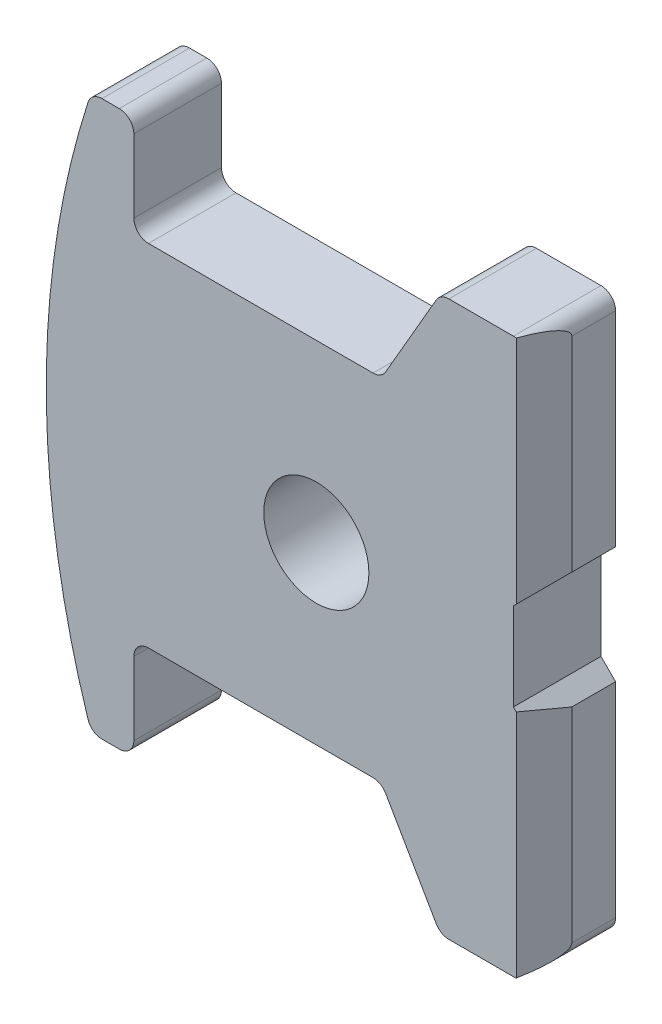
ISO-10303-21;
HEADER;
FILE_DESCRIPTION(('STEP AP214'),'2;1');
FILE_NAME('part.step','',(''),(''),'','','');
FILE_SCHEMA(('AUTOMOTIVE_DESIGN { 1 0 10303 214 1 1 1 1 }'));
ENDSEC;
DATA;
#1=APPLICATION_CONTEXT('core data for automotive mechanical design processes');
#2=APPLICATION_PROTOCOL_DEFINITION('international standard','automotive_design',2000,#1);
#3=PRODUCT_CONTEXT('',#1,'mechanical');
#4=PRODUCT('Part','Part','',(#3));
#5=PRODUCT_RELATED_PRODUCT_CATEGORY('part','',(#4));
#6=PRODUCT_DEFINITION_FORMATION('','',#4);
#7=PRODUCT_DEFINITION_CONTEXT('part definition',#1,'design');
#8=PRODUCT_DEFINITION('design','',#6,#7);
#9=PRODUCT_DEFINITION_SHAPE('','',#8);
#10=(LENGTH_UNIT() NAMED_UNIT(*) SI_UNIT(.MILLI.,.METRE.));
#11=(NAMED_UNIT(*) PLANE_ANGLE_UNIT() SI_UNIT($,.RADIAN.));
#12=(NAMED_UNIT(*) SI_UNIT($,.STERADIAN.) SOLID_ANGLE_UNIT());
#13=UNCERTAINTY_MEASURE_WITH_UNIT(LENGTH_MEASURE(1.E-05),#10,'distance_accuracy_value','');
#14=(GEOMETRIC_REPRESENTATION_CONTEXT(3) GLOBAL_UNCERTAINTY_ASSIGNED_CONTEXT((#13)) GLOBAL_UNIT_ASSIGNED_CONTEXT((#10,
#11,#12)) REPRESENTATION_CONTEXT('',''));
#15=CARTESIAN_POINT('',(0.,0.,0.));
#16=DIRECTION('',(0.,0.,1.));
#17=DIRECTION('',(1.,0.,0.));
#18=AXIS2_PLACEMENT_3D('',#15,#16,#17);
#19=CARTESIAN_POINT('',(-28.,19.,6.));
#20=DIRECTION('',(0.,-1.,0.));
#21=DIRECTION('',(1.,0.,0.));
#22=AXIS2_PLACEMENT_3D('',#19,#20,#21);
#23=PLANE('',#22);
#24=DIRECTION('',(-1.,0.,0.));
#25=VECTOR('',#24,1.);
#26=CARTESIAN_POINT('',(-28.,19.,0.));
#27=LINE('',#26,#25);
#28=CARTESIAN_POINT('',(-28.,19.,0.));
#29=VERTEX_POINT('',#28);
#30=CARTESIAN_POINT('',(-29.1871871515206,19.,0.));
#31=VERTEX_POINT('',#30);
#32=EDGE_CURVE('E353',#29,#31,#27,.T.);
#33=ORIENTED_EDGE('',*,*,#32,.T.);
#34=DIRECTION('',(0.,0.,1.));
#35=VECTOR('',#34,1.);
#36=CARTESIAN_POINT('',(-29.1871871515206,19.,6.));
#37=LINE('',#36,#35);
#38=CARTESIAN_POINT('',(-29.1871871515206,19.,6.));
#39=VERTEX_POINT('',#38);
#40=EDGE_CURVE('E37',#31,#39,#37,.T.);
#41=ORIENTED_EDGE('',*,*,#40,.T.);
#42=DIRECTION('',(1.,0.,0.));
#43=VECTOR('',#42,1.);
#44=CARTESIAN_POINT('',(-28.,19.,6.));
#45=LINE('',#44,#43);
#46=CARTESIAN_POINT('',(-28.,19.,6.));
#47=VERTEX_POINT('',#46);
#48=EDGE_CURVE('E210',#39,#47,#45,.T.);
#49=ORIENTED_EDGE('',*,*,#48,.T.);
#50=DIRECTION('',(0.,0.,-1.));
#51=VECTOR('',#50,1.);
#52=CARTESIAN_POINT('',(-28.,19.,6.));
#53=LINE('',#52,#51);
#54=EDGE_CURVE('E213',#47,#29,#53,.T.);
#55=ORIENTED_EDGE('',*,*,#54,.T.);
#56=EDGE_LOOP('',(#33,#41,#49,#55));
#57=FACE_BOUND('',#56,.T.);
#58=ADVANCED_FACE('F14',(#57),#23,.F.);
#59=CARTESIAN_POINT('',(-28.,-19.,6.));
#60=DIRECTION('',(0.,1.,0.));
#61=DIRECTION('',(-1.,0.,0.));
#62=AXIS2_PLACEMENT_3D('',#59,#60,#61);
#63=PLANE('',#62);
#64=DIRECTION('',(-1.,0.,0.));
#65=VECTOR('',#64,1.);
#66=CARTESIAN_POINT('',(-30.5,-19.,6.));
#67=LINE('',#66,#65);
#68=CARTESIAN_POINT('',(-28.,-19.,6.));
#69=VERTEX_POINT('',#68);
#70=CARTESIAN_POINT('',(-29.1871871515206,-19.,6.));
#71=VERTEX_POINT('',#70);
#72=EDGE_CURVE('E515',#69,#71,#67,.T.);
#73=ORIENTED_EDGE('',*,*,#72,.T.);
#74=DIRECTION('',(0.,0.,1.));
#75=VECTOR('',#74,1.);
#76=CARTESIAN_POINT('',(-29.1871871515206,-19.,0.));
#77=LINE('',#76,#75);
#78=CARTESIAN_POINT('',(-29.1871871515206,-19.,0.));
#79=VERTEX_POINT('',#78);
#80=EDGE_CURVE('E9',#71,#79,#77,.F.);
#81=ORIENTED_EDGE('',*,*,#80,.T.);
#82=DIRECTION('',(1.,0.,0.));
#83=VECTOR('',#82,1.);
#84=CARTESIAN_POINT('',(-28.,-19.,0.));
#85=LINE('',#84,#83);
#86=CARTESIAN_POINT('',(-28.,-19.,0.));
#87=VERTEX_POINT('',#86);
#88=EDGE_CURVE('E354',#79,#87,#85,.T.);
#89=ORIENTED_EDGE('',*,*,#88,.T.);
#90=DIRECTION('',(0.,0.,-1.));
#91=VECTOR('',#90,1.);
#92=CARTESIAN_POINT('',(-28.,-19.,6.));
#93=LINE('',#92,#91);
#94=EDGE_CURVE('E231',#69,#87,#93,.T.);
#95=ORIENTED_EDGE('',*,*,#94,.F.);
#96=EDGE_LOOP('',(#73,#81,#89,#95));
#97=FACE_BOUND('',#96,.T.);
#98=ADVANCED_FACE('F535',(#97),#63,.F.);
#99=CARTESIAN_POINT('',(-26.,-13.,6.));
#100=DIRECTION('',(0.,0.,1.));
#101=DIRECTION('',(0.,1.,0.));
#102=AXIS2_PLACEMENT_3D('',#99,#100,#101);
#103=PLANE('',#102);
#104=CARTESIAN_POINT('',(-14.5,0.,6.));
#105=DIRECTION('',(0.,0.,1.));
#106=DIRECTION('',(0.,1.,0.));
#107=AXIS2_PLACEMENT_3D('',#104,#105,#106);
#108=CIRCLE('',#107,3.6);
#109=CARTESIAN_POINT('',(-14.5,3.60000000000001,6.));
#110=VERTEX_POINT('',#109);
#111=EDGE_CURVE('E517',#110,#110,#108,.T.);
#112=ORIENTED_EDGE('',*,*,#111,.F.);
#113=EDGE_LOOP('',(#112));
#114=FACE_BOUND('',#113,.T.);
#115=ORIENTED_EDGE('',*,*,#48,.F.);
#116=CARTESIAN_POINT('',(-29.1871871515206,18.,6.));
#117=DIRECTION('',(0.,0.,1.));
#118=DIRECTION('',(0.,1.,0.));
#119=AXIS2_PLACEMENT_3D('',#116,#117,#118);
#120=CIRCLE('',#119,1.);
#121=CARTESIAN_POINT('',(-30.1395123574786,18.3050847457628,6.));
#122=VERTEX_POINT('',#121);
#123=EDGE_CURVE('E22',#39,#122,#120,.T.);
#124=ORIENTED_EDGE('',*,*,#123,.T.);
#125=CARTESIAN_POINT('',(27.,0.,6.));
#126=DIRECTION('',(0.,0.,1.));
#127=DIRECTION('',(0.,1.,0.));
#128=AXIS2_PLACEMENT_3D('',#125,#126,#127);
#129=CIRCLE('',#128,60.);
#130=CARTESIAN_POINT('',(-30.1395123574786,-18.3050847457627,6.));
#131=VERTEX_POINT('',#130);
#132=EDGE_CURVE('E339',#122,#131,#129,.T.);
#133=ORIENTED_EDGE('',*,*,#132,.T.);
#134=CARTESIAN_POINT('',(-29.1871871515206,-18.,6.));
#135=DIRECTION('',(0.,0.,1.));
#136=DIRECTION('',(0.,1.,0.));
#137=AXIS2_PLACEMENT_3D('',#134,#135,#136);
#138=CIRCLE('',#137,1.);
#139=EDGE_CURVE('E29',#131,#71,#138,.T.);
#140=ORIENTED_EDGE('',*,*,#139,.T.);
#141=ORIENTED_EDGE('',*,*,#72,.F.);
#142=CARTESIAN_POINT('',(-28.,-18.,6.));
#143=DIRECTION('',(0.,0.,1.));
#144=DIRECTION('',(0.,1.,0.));
#145=AXIS2_PLACEMENT_3D('',#142,#143,#144);
#146=CIRCLE('',#145,1.);
#147=CARTESIAN_POINT('',(-27.,-18.,6.));
#148=VERTEX_POINT('',#147);
#149=EDGE_CURVE('E510',#148,#69,#146,.F.);
#150=ORIENTED_EDGE('',*,*,#149,.F.);
#151=DIRECTION('',(0.,-1.,0.));
#152=VECTOR('',#151,1.);
#153=CARTESIAN_POINT('',(-27.,-18.,6.));
#154=LINE('',#153,#152);
#155=CARTESIAN_POINT('',(-27.,-13.,6.));
#156=VERTEX_POINT('',#155);
#157=EDGE_CURVE('E370',#156,#148,#154,.T.);
#158=ORIENTED_EDGE('',*,*,#157,.F.);
#159=CARTESIAN_POINT('',(-26.,-13.,6.));
#160=DIRECTION('',(0.,0.,-1.));
#161=DIRECTION('',(0.,1.,0.));
#162=AXIS2_PLACEMENT_3D('',#159,#160,#161);
#163=CIRCLE('',#162,1.);
#164=CARTESIAN_POINT('',(-26.,-12.,6.));
#165=VERTEX_POINT('',#164);
#166=EDGE_CURVE('E296',#156,#165,#163,.T.);
#167=ORIENTED_EDGE('',*,*,#166,.T.);
#168=DIRECTION('',(1.,0.,0.));
#169=VECTOR('',#168,1.);
#170=CARTESIAN_POINT('',(-10.618802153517,-12.,6.));
#171=LINE('',#170,#169);
#172=CARTESIAN_POINT('',(-10.618802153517,-12.,6.));
#173=VERTEX_POINT('',#172);
#174=EDGE_CURVE('E299',#165,#173,#171,.T.);
#175=ORIENTED_EDGE('',*,*,#174,.T.);
#176=CARTESIAN_POINT('',(-10.618802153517,-13.,6.));
#177=DIRECTION('',(0.,0.,-1.));
#178=DIRECTION('',(0.,1.,0.));
#179=AXIS2_PLACEMENT_3D('',#176,#177,#178);
#180=CIRCLE('',#179,1.);
#181=CARTESIAN_POINT('',(-9.75277674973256,-12.5,6.));
#182=VERTEX_POINT('',#181);
#183=EDGE_CURVE('E502',#173,#182,#180,.T.);
#184=ORIENTED_EDGE('',*,*,#183,.T.);
#185=DIRECTION('',(0.5,-0.86602540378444,0.));
#186=VECTOR('',#185,1.);
#187=CARTESIAN_POINT('',(-6.28867513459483,-18.5,6.));
#188=LINE('',#187,#186);
#189=CARTESIAN_POINT('',(-6.28867513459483,-18.5,6.));
#190=VERTEX_POINT('',#189);
#191=EDGE_CURVE('E500',#182,#190,#188,.T.);
#192=ORIENTED_EDGE('',*,*,#191,.T.);
#193=CARTESIAN_POINT('',(-5.42264973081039,-18.,6.));
#194=DIRECTION('',(0.,0.,1.));
#195=DIRECTION('',(0.,-1.,0.));
#196=AXIS2_PLACEMENT_3D('',#193,#194,#195);
#197=CIRCLE('',#196,1.);
#198=CARTESIAN_POINT('',(-5.42264973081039,-19.,6.));
#199=VERTEX_POINT('',#198);
#200=EDGE_CURVE('E498',#190,#199,#197,.T.);
#201=ORIENTED_EDGE('',*,*,#200,.T.);
#202=DIRECTION('',(1.,0.,0.));
#203=VECTOR('',#202,1.);
#204=CARTESIAN_POINT('',(0.,-19.,6.));
#205=LINE('',#204,#203);
#206=CARTESIAN_POINT('',(-1.00000000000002,-19.,6.));
#207=VERTEX_POINT('',#206);
#208=EDGE_CURVE('E495',#199,#207,#205,.T.);
#209=ORIENTED_EDGE('',*,*,#208,.T.);
#210=CARTESIAN_POINT('',(-1.00000000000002,-18.,6.));
#211=DIRECTION('',(0.,0.,1.));
#212=DIRECTION('',(0.,1.,0.));
#213=AXIS2_PLACEMENT_3D('',#210,#211,#212);
#214=CIRCLE('',#213,1.);
#215=CARTESIAN_POINT('',(-0.803847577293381,-18.980573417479,6.));
#216=VERTEX_POINT('',#215);
#217=EDGE_CURVE('E317',#207,#216,#214,.T.);
#218=ORIENTED_EDGE('',*,*,#217,.T.);
#219=DIRECTION('',(0.,-1.,0.));
#220=VECTOR('',#219,1.);
#221=CARTESIAN_POINT('',(-0.803847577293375,-13.,6.));
#222=LINE('',#221,#220);
#223=CARTESIAN_POINT('',(-0.803847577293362,-3.19615242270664,6.));
#224=VERTEX_POINT('',#223);
#225=EDGE_CURVE('E281',#224,#216,#222,.T.);
#226=ORIENTED_EDGE('',*,*,#225,.F.);
#227=DIRECTION('',(-0.707106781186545,0.70710678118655,0.));
#228=VECTOR('',#227,1.);
#229=CARTESIAN_POINT('',(0.,-4.,6.));
#230=LINE('',#229,#228);
#231=CARTESIAN_POINT('',(-1.,-3.,6.));
#232=VERTEX_POINT('',#231);
#233=EDGE_CURVE('E489',#224,#232,#230,.T.);
#234=ORIENTED_EDGE('',*,*,#233,.T.);
#235=DIRECTION('',(0.,1.,0.));
#236=VECTOR('',#235,1.);
#237=CARTESIAN_POINT('',(-1.,-3.,6.));
#238=LINE('',#237,#236);
#239=CARTESIAN_POINT('',(-1.,3.,6.));
#240=VERTEX_POINT('',#239);
#241=EDGE_CURVE('E484',#232,#240,#238,.T.);
#242=ORIENTED_EDGE('',*,*,#241,.T.);
#243=DIRECTION('',(0.707106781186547,0.707106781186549,0.));
#244=VECTOR('',#243,1.);
#245=CARTESIAN_POINT('',(0.,4.,6.));
#246=LINE('',#245,#244);
#247=CARTESIAN_POINT('',(-0.803847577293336,3.19615242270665,6.));
#248=VERTEX_POINT('',#247);
#249=EDGE_CURVE('E482',#240,#248,#246,.T.);
#250=ORIENTED_EDGE('',*,*,#249,.T.);
#251=CARTESIAN_POINT('',(-0.803847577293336,18.980573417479,6.));
#252=VERTEX_POINT('',#251);
#253=EDGE_CURVE('E305',#252,#248,#222,.T.);
#254=ORIENTED_EDGE('',*,*,#253,.F.);
#255=CARTESIAN_POINT('',(-0.999999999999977,18.,6.));
#256=DIRECTION('',(0.,0.,1.));
#257=DIRECTION('',(0.,1.,0.));
#258=AXIS2_PLACEMENT_3D('',#255,#256,#257);
#259=CIRCLE('',#258,1.);
#260=CARTESIAN_POINT('',(-0.999999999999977,19.,6.));
#261=VERTEX_POINT('',#260);
#262=EDGE_CURVE('E315',#252,#261,#259,.T.);
#263=ORIENTED_EDGE('',*,*,#262,.T.);
#264=DIRECTION('',(-1.,0.,0.));
#265=VECTOR('',#264,1.);
#266=CARTESIAN_POINT('',(-5.42264973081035,19.,6.));
#267=LINE('',#266,#265);
#268=CARTESIAN_POINT('',(-5.42264973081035,19.,6.));
#269=VERTEX_POINT('',#268);
#270=EDGE_CURVE('E462',#261,#269,#267,.T.);
#271=ORIENTED_EDGE('',*,*,#270,.T.);
#272=CARTESIAN_POINT('',(-5.42264973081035,18.,6.));
#273=DIRECTION('',(0.,0.,1.));
#274=DIRECTION('',(0.,1.,0.));
#275=AXIS2_PLACEMENT_3D('',#272,#273,#274);
#276=CIRCLE('',#275,1.);
#277=CARTESIAN_POINT('',(-6.28867513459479,18.5,6.));
#278=VERTEX_POINT('',#277);
#279=EDGE_CURVE('E457',#269,#278,#276,.T.);
#280=ORIENTED_EDGE('',*,*,#279,.T.);
#281=DIRECTION('',(-0.5,-0.866025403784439,0.));
#282=VECTOR('',#281,1.);
#283=CARTESIAN_POINT('',(-9.75277674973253,12.5,6.));
#284=LINE('',#283,#282);
#285=CARTESIAN_POINT('',(-9.75277674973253,12.5,6.));
#286=VERTEX_POINT('',#285);
#287=EDGE_CURVE('E453',#278,#286,#284,.T.);
#288=ORIENTED_EDGE('',*,*,#287,.T.);
#289=CARTESIAN_POINT('',(-10.618802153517,13.,6.));
#290=DIRECTION('',(0.,0.,-1.));
#291=DIRECTION('',(0.,-1.,0.));
#292=AXIS2_PLACEMENT_3D('',#289,#290,#291);
#293=CIRCLE('',#292,1.);
#294=CARTESIAN_POINT('',(-10.618802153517,12.,6.));
#295=VERTEX_POINT('',#294);
#296=EDGE_CURVE('E444',#286,#295,#293,.T.);
#297=ORIENTED_EDGE('',*,*,#296,.T.);
#298=DIRECTION('',(-1.,0.,0.));
#299=VECTOR('',#298,1.);
#300=CARTESIAN_POINT('',(-26.,12.,6.));
#301=LINE('',#300,#299);
#302=CARTESIAN_POINT('',(-26.,12.,6.));
#303=VERTEX_POINT('',#302);
#304=EDGE_CURVE('E285',#295,#303,#301,.T.);
#305=ORIENTED_EDGE('',*,*,#304,.T.);
#306=CARTESIAN_POINT('',(-26.,13.,6.));
#307=DIRECTION('',(0.,0.,-1.));
#308=DIRECTION('',(0.,-1.,0.));
#309=AXIS2_PLACEMENT_3D('',#306,#307,#308);
#310=CIRCLE('',#309,1.);
#311=CARTESIAN_POINT('',(-27.,13.,6.));
#312=VERTEX_POINT('',#311);
#313=EDGE_CURVE('E282',#303,#312,#310,.T.);
#314=ORIENTED_EDGE('',*,*,#313,.T.);
#315=CARTESIAN_POINT('',(-27.,18.,6.));
#316=VERTEX_POINT('',#315);
#317=EDGE_CURVE('E222',#316,#312,#154,.T.);
#318=ORIENTED_EDGE('',*,*,#317,.F.);
#319=CARTESIAN_POINT('',(-28.,18.,6.));
#320=DIRECTION('',(0.,0.,1.));
#321=DIRECTION('',(0.,1.,0.));
#322=AXIS2_PLACEMENT_3D('',#319,#320,#321);
#323=CIRCLE('',#322,1.);
#324=EDGE_CURVE('E217',#47,#316,#323,.F.);
#325=ORIENTED_EDGE('',*,*,#324,.F.);
#326=EDGE_LOOP('',(#115,#124,#133,#140,#141,#150,#158,#167,#175,#184,#192,#201,#209,#218,#226,
#234,#242,#250,#254,#263,#271,#280,#288,#297,#305,#314,#318,#325));
#327=FACE_BOUND('',#326,.T.);
#328=ADVANCED_FACE('F220',(#114,#327),#103,.T.);
#329=CARTESIAN_POINT('',(-26.,-13.,0.));
#330=DIRECTION('',(0.,0.,1.));
#331=DIRECTION('',(0.,1.,0.));
#332=AXIS2_PLACEMENT_3D('',#329,#330,#331);
#333=PLANE('',#332);
#334=CARTESIAN_POINT('',(-14.5,0.,0.));
#335=DIRECTION('',(0.,0.,-1.));
#336=DIRECTION('',(0.,-1.,0.));
#337=AXIS2_PLACEMENT_3D('',#334,#335,#336);
#338=CIRCLE('',#337,3.6);
#339=CARTESIAN_POINT('',(-14.5,-3.59999999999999,0.));
#340=VERTEX_POINT('',#339);
#341=EDGE_CURVE('E347',#340,#340,#338,.T.);
#342=ORIENTED_EDGE('',*,*,#341,.F.);
#343=EDGE_LOOP('',(#342));
#344=FACE_BOUND('',#343,.T.);
#345=CARTESIAN_POINT('',(27.,0.,0.));
#346=DIRECTION('',(0.,0.,-1.));
#347=DIRECTION('',(0.,-1.,0.));
#348=AXIS2_PLACEMENT_3D('',#345,#346,#347);
#349=CIRCLE('',#348,60.);
#350=CARTESIAN_POINT('',(-30.1395123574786,-18.3050847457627,0.));
#351=VERTEX_POINT('',#350);
#352=CARTESIAN_POINT('',(-30.1395123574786,18.3050847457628,0.));
#353=VERTEX_POINT('',#352);
#354=EDGE_CURVE('E348',#351,#353,#349,.T.);
#355=ORIENTED_EDGE('',*,*,#354,.T.);
#356=CARTESIAN_POINT('',(-29.1871871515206,18.,0.));
#357=DIRECTION('',(0.,0.,1.));
#358=DIRECTION('',(0.,1.,0.));
#359=AXIS2_PLACEMENT_3D('',#356,#357,#358);
#360=CIRCLE('',#359,1.);
#361=EDGE_CURVE('E335',#353,#31,#360,.F.);
#362=ORIENTED_EDGE('',*,*,#361,.T.);
#363=ORIENTED_EDGE('',*,*,#32,.F.);
#364=CARTESIAN_POINT('',(-28.,18.,0.));
#365=DIRECTION('',(0.,0.,1.));
#366=DIRECTION('',(0.,1.,0.));
#367=AXIS2_PLACEMENT_3D('',#364,#365,#366);
#368=CIRCLE('',#367,1.);
#369=CARTESIAN_POINT('',(-27.,18.,0.));
#370=VERTEX_POINT('',#369);
#371=EDGE_CURVE('E228',#370,#29,#368,.T.);
#372=ORIENTED_EDGE('',*,*,#371,.F.);
#373=DIRECTION('',(0.,1.,0.));
#374=VECTOR('',#373,1.);
#375=CARTESIAN_POINT('',(-27.,18.,0.));
#376=LINE('',#375,#374);
#377=CARTESIAN_POINT('',(-27.,13.,0.));
#378=VERTEX_POINT('',#377);
#379=EDGE_CURVE('E358',#378,#370,#376,.T.);
#380=ORIENTED_EDGE('',*,*,#379,.F.);
#381=CARTESIAN_POINT('',(-26.,13.,0.));
#382=DIRECTION('',(0.,0.,-1.));
#383=DIRECTION('',(0.,-1.,0.));
#384=AXIS2_PLACEMENT_3D('',#381,#382,#383);
#385=CIRCLE('',#384,1.);
#386=CARTESIAN_POINT('',(-26.,12.,0.));
#387=VERTEX_POINT('',#386);
#388=EDGE_CURVE('E424',#387,#378,#385,.T.);
#389=ORIENTED_EDGE('',*,*,#388,.F.);
#390=DIRECTION('',(-1.,0.,0.));
#391=VECTOR('',#390,1.);
#392=CARTESIAN_POINT('',(-26.,12.,0.));
#393=LINE('',#392,#391);
#394=CARTESIAN_POINT('',(-10.618802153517,12.,0.));
#395=VERTEX_POINT('',#394);
#396=EDGE_CURVE('E422',#395,#387,#393,.T.);
#397=ORIENTED_EDGE('',*,*,#396,.F.);
#398=CARTESIAN_POINT('',(-10.618802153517,13.,0.));
#399=DIRECTION('',(0.,0.,-1.));
#400=DIRECTION('',(0.,-1.,0.));
#401=AXIS2_PLACEMENT_3D('',#398,#399,#400);
#402=CIRCLE('',#401,1.);
#403=CARTESIAN_POINT('',(-9.75277674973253,12.5,0.));
#404=VERTEX_POINT('',#403);
#405=EDGE_CURVE('E420',#404,#395,#402,.T.);
#406=ORIENTED_EDGE('',*,*,#405,.F.);
#407=DIRECTION('',(-0.5,-0.866025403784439,0.));
#408=VECTOR('',#407,1.);
#409=CARTESIAN_POINT('',(-9.75277674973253,12.5,0.));
#410=LINE('',#409,#408);
#411=CARTESIAN_POINT('',(-6.28867513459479,18.5,0.));
#412=VERTEX_POINT('',#411);
#413=EDGE_CURVE('E418',#412,#404,#410,.T.);
#414=ORIENTED_EDGE('',*,*,#413,.F.);
#415=CARTESIAN_POINT('',(-5.42264973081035,18.,0.));
#416=DIRECTION('',(0.,0.,1.));
#417=DIRECTION('',(0.,1.,0.));
#418=AXIS2_PLACEMENT_3D('',#415,#416,#417);
#419=CIRCLE('',#418,1.);
#420=CARTESIAN_POINT('',(-5.42264973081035,19.,0.));
#421=VERTEX_POINT('',#420);
#422=EDGE_CURVE('E416',#421,#412,#419,.T.);
#423=ORIENTED_EDGE('',*,*,#422,.F.);
#424=DIRECTION('',(-1.,0.,0.));
#425=VECTOR('',#424,1.);
#426=CARTESIAN_POINT('',(-5.42264973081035,19.,0.));
#427=LINE('',#426,#425);
#428=CARTESIAN_POINT('',(-0.999999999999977,19.,0.));
#429=VERTEX_POINT('',#428);
#430=EDGE_CURVE('E414',#429,#421,#427,.T.);
#431=ORIENTED_EDGE('',*,*,#430,.F.);
#432=CARTESIAN_POINT('',(-0.999999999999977,18.,0.));
#433=DIRECTION('',(0.,0.,1.));
#434=DIRECTION('',(0.,1.,0.));
#435=AXIS2_PLACEMENT_3D('',#432,#433,#434);
#436=CIRCLE('',#435,1.);
#437=CARTESIAN_POINT('',(0.,18.,0.));
#438=VERTEX_POINT('',#437);
#439=EDGE_CURVE('E309',#429,#438,#436,.F.);
#440=ORIENTED_EDGE('',*,*,#439,.T.);
#441=DIRECTION('',(0.,1.,0.));
#442=VECTOR('',#441,1.);
#443=CARTESIAN_POINT('',(0.,19.,0.));
#444=LINE('',#443,#442);
#445=CARTESIAN_POINT('',(0.,4.,0.));
#446=VERTEX_POINT('',#445);
#447=EDGE_CURVE('E411',#446,#438,#444,.T.);
#448=ORIENTED_EDGE('',*,*,#447,.F.);
#449=DIRECTION('',(0.707106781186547,0.707106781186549,0.));
#450=VECTOR('',#449,1.);
#451=CARTESIAN_POINT('',(0.,4.,0.));
#452=LINE('',#451,#450);
#453=CARTESIAN_POINT('',(-1.,3.,0.));
#454=VERTEX_POINT('',#453);
#455=EDGE_CURVE('E408',#454,#446,#452,.T.);
#456=ORIENTED_EDGE('',*,*,#455,.F.);
#457=DIRECTION('',(0.,1.,0.));
#458=VECTOR('',#457,1.);
#459=CARTESIAN_POINT('',(-1.,-3.,0.));
#460=LINE('',#459,#458);
#461=CARTESIAN_POINT('',(-1.,-3.,0.));
#462=VERTEX_POINT('',#461);
#463=EDGE_CURVE('E406',#462,#454,#460,.T.);
#464=ORIENTED_EDGE('',*,*,#463,.F.);
#465=DIRECTION('',(-0.707106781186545,0.70710678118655,0.));
#466=VECTOR('',#465,1.);
#467=CARTESIAN_POINT('',(0.,-4.,0.));
#468=LINE('',#467,#466);
#469=CARTESIAN_POINT('',(0.,-4.,0.));
#470=VERTEX_POINT('',#469);
#471=EDGE_CURVE('E404',#470,#462,#468,.T.);
#472=ORIENTED_EDGE('',*,*,#471,.F.);
#473=DIRECTION('',(0.,1.,0.));
#474=VECTOR('',#473,1.);
#475=CARTESIAN_POINT('',(0.,-4.,0.));
#476=LINE('',#475,#474);
#477=CARTESIAN_POINT('',(0.,-18.,0.));
#478=VERTEX_POINT('',#477);
#479=EDGE_CURVE('E402',#478,#470,#476,.T.);
#480=ORIENTED_EDGE('',*,*,#479,.F.);
#481=CARTESIAN_POINT('',(-1.00000000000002,-18.,0.));
#482=DIRECTION('',(0.,0.,1.));
#483=DIRECTION('',(0.,1.,0.));
#484=AXIS2_PLACEMENT_3D('',#481,#482,#483);
#485=CIRCLE('',#484,1.);
#486=CARTESIAN_POINT('',(-1.00000000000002,-19.,0.));
#487=VERTEX_POINT('',#486);
#488=EDGE_CURVE('E311',#478,#487,#485,.F.);
#489=ORIENTED_EDGE('',*,*,#488,.T.);
#490=DIRECTION('',(1.,0.,0.));
#491=VECTOR('',#490,1.);
#492=CARTESIAN_POINT('',(0.,-19.,0.));
#493=LINE('',#492,#491);
#494=CARTESIAN_POINT('',(-5.42264973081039,-19.,0.));
#495=VERTEX_POINT('',#494);
#496=EDGE_CURVE('E399',#495,#487,#493,.T.);
#497=ORIENTED_EDGE('',*,*,#496,.F.);
#498=CARTESIAN_POINT('',(-5.42264973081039,-18.,0.));
#499=DIRECTION('',(0.,0.,1.));
#500=DIRECTION('',(0.,-1.,0.));
#501=AXIS2_PLACEMENT_3D('',#498,#499,#500);
#502=CIRCLE('',#501,1.);
#503=CARTESIAN_POINT('',(-6.28867513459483,-18.5,0.));
#504=VERTEX_POINT('',#503);
#505=EDGE_CURVE('E397',#504,#495,#502,.T.);
#506=ORIENTED_EDGE('',*,*,#505,.F.);
#507=DIRECTION('',(0.5,-0.86602540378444,0.));
#508=VECTOR('',#507,1.);
#509=CARTESIAN_POINT('',(-6.28867513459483,-18.5,0.));
#510=LINE('',#509,#508);
#511=CARTESIAN_POINT('',(-9.75277674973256,-12.5,0.));
#512=VERTEX_POINT('',#511);
#513=EDGE_CURVE('E395',#512,#504,#510,.T.);
#514=ORIENTED_EDGE('',*,*,#513,.F.);
#515=CARTESIAN_POINT('',(-10.618802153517,-13.,0.));
#516=DIRECTION('',(0.,0.,-1.));
#517=DIRECTION('',(0.,1.,0.));
#518=AXIS2_PLACEMENT_3D('',#515,#516,#517);
#519=CIRCLE('',#518,1.);
#520=CARTESIAN_POINT('',(-10.618802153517,-12.,0.));
#521=VERTEX_POINT('',#520);
#522=EDGE_CURVE('E386',#521,#512,#519,.T.);
#523=ORIENTED_EDGE('',*,*,#522,.F.);
#524=DIRECTION('',(1.,0.,0.));
#525=VECTOR('',#524,1.);
#526=CARTESIAN_POINT('',(-10.618802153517,-12.,0.));
#527=LINE('',#526,#525);
#528=CARTESIAN_POINT('',(-26.,-12.,0.));
#529=VERTEX_POINT('',#528);
#530=EDGE_CURVE('E381',#529,#521,#527,.T.);
#531=ORIENTED_EDGE('',*,*,#530,.F.);
#532=CARTESIAN_POINT('',(-26.,-13.,0.));
#533=DIRECTION('',(0.,0.,-1.));
#534=DIRECTION('',(0.,1.,0.));
#535=AXIS2_PLACEMENT_3D('',#532,#533,#534);
#536=CIRCLE('',#535,1.);
#537=CARTESIAN_POINT('',(-27.,-13.,0.));
#538=VERTEX_POINT('',#537);
#539=EDGE_CURVE('E379',#538,#529,#536,.T.);
#540=ORIENTED_EDGE('',*,*,#539,.F.);
#541=DIRECTION('',(0.,1.,0.));
#542=VECTOR('',#541,1.);
#543=CARTESIAN_POINT('',(-27.,-18.,0.));
#544=LINE('',#543,#542);
#545=CARTESIAN_POINT('',(-27.,-18.,0.));
#546=VERTEX_POINT('',#545);
#547=EDGE_CURVE('E300',#546,#538,#544,.T.);
#548=ORIENTED_EDGE('',*,*,#547,.F.);
#549=CARTESIAN_POINT('',(-28.,-18.,0.));
#550=DIRECTION('',(0.,0.,1.));
#551=DIRECTION('',(0.,1.,0.));
#552=AXIS2_PLACEMENT_3D('',#549,#550,#551);
#553=CIRCLE('',#552,1.);
#554=EDGE_CURVE('E356',#87,#546,#553,.T.);
#555=ORIENTED_EDGE('',*,*,#554,.F.);
#556=ORIENTED_EDGE('',*,*,#88,.F.);
#557=CARTESIAN_POINT('',(-29.1871871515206,-18.,0.));
#558=DIRECTION('',(0.,0.,1.));
#559=DIRECTION('',(0.,1.,0.));
#560=AXIS2_PLACEMENT_3D('',#557,#558,#559);
#561=CIRCLE('',#560,1.);
#562=EDGE_CURVE('E333',#79,#351,#561,.F.);
#563=ORIENTED_EDGE('',*,*,#562,.T.);
#564=EDGE_LOOP('',(#355,#362,#363,#372,#380,#389,#397,#406,#414,#423,#431,#440,#448,#456,#464,
#472,#480,#489,#497,#506,#514,#523,#531,#540,#548,#555,#556,#563));
#565=FACE_BOUND('',#564,.T.);
#566=ADVANCED_FACE('F352',(#344,#565),#333,.F.);
#567=CARTESIAN_POINT('',(-28.,18.,6.));
#568=DIRECTION('',(0.,0.,-1.));
#569=DIRECTION('',(0.,-1.,0.));
#570=AXIS2_PLACEMENT_3D('',#567,#568,#569);
#571=CYLINDRICAL_SURFACE('',#570,1.);
#572=ORIENTED_EDGE('',*,*,#324,.T.);
#573=DIRECTION('',(0.,0.,-1.));
#574=VECTOR('',#573,1.);
#575=CARTESIAN_POINT('',(-27.,18.,6.));
#576=LINE('',#575,#574);
#577=EDGE_CURVE('E230',#316,#370,#576,.T.);
#578=ORIENTED_EDGE('',*,*,#577,.T.);
#579=ORIENTED_EDGE('',*,*,#371,.T.);
#580=ORIENTED_EDGE('',*,*,#54,.F.);
#581=EDGE_LOOP('',(#572,#578,#579,#580));
#582=FACE_BOUND('',#581,.T.);
#583=ADVANCED_FACE('F226',(#582),#571,.T.);
#584=CARTESIAN_POINT('',(-28.,-18.,6.));
#585=DIRECTION('',(0.,0.,-1.));
#586=DIRECTION('',(0.,-1.,0.));
#587=AXIS2_PLACEMENT_3D('',#584,#585,#586);
#588=CYLINDRICAL_SURFACE('',#587,1.);
#589=ORIENTED_EDGE('',*,*,#149,.T.);
#590=ORIENTED_EDGE('',*,*,#94,.T.);
#591=ORIENTED_EDGE('',*,*,#554,.T.);
#592=DIRECTION('',(0.,0.,-1.));
#593=VECTOR('',#592,1.);
#594=CARTESIAN_POINT('',(-27.,-18.,6.));
#595=LINE('',#594,#593);
#596=EDGE_CURVE('E236',#148,#546,#595,.T.);
#597=ORIENTED_EDGE('',*,*,#596,.F.);
#598=EDGE_LOOP('',(#589,#590,#591,#597));
#599=FACE_BOUND('',#598,.T.);
#600=ADVANCED_FACE('F374',(#599),#588,.T.);
#601=CARTESIAN_POINT('',(-27.,-18.,6.));
#602=DIRECTION('',(-1.,0.,0.));
#603=DIRECTION('',(0.,-1.,0.));
#604=AXIS2_PLACEMENT_3D('',#601,#602,#603);
#605=PLANE('',#604);
#606=ORIENTED_EDGE('',*,*,#157,.T.);
#607=ORIENTED_EDGE('',*,*,#596,.T.);
#608=ORIENTED_EDGE('',*,*,#547,.T.);
#609=DIRECTION('',(0.,0.,-1.));
#610=VECTOR('',#609,1.);
#611=CARTESIAN_POINT('',(-27.,-13.,6.));
#612=LINE('',#611,#610);
#613=EDGE_CURVE('E284',#156,#538,#612,.T.);
#614=ORIENTED_EDGE('',*,*,#613,.F.);
#615=EDGE_LOOP('',(#606,#607,#608,#614));
#616=FACE_BOUND('',#615,.T.);
#617=ADVANCED_FACE('F367',(#616),#605,.F.);
#618=ORIENTED_EDGE('',*,*,#317,.T.);
#619=DIRECTION('',(0.,0.,-1.));
#620=VECTOR('',#619,1.);
#621=CARTESIAN_POINT('',(-27.,13.,6.));
#622=LINE('',#621,#620);
#623=EDGE_CURVE('E233',#312,#378,#622,.T.);
#624=ORIENTED_EDGE('',*,*,#623,.T.);
#625=ORIENTED_EDGE('',*,*,#379,.T.);
#626=ORIENTED_EDGE('',*,*,#577,.F.);
#627=EDGE_LOOP('',(#618,#624,#625,#626));
#628=FACE_BOUND('',#627,.T.);
#629=ADVANCED_FACE('F428',(#628),#605,.F.);
#630=CARTESIAN_POINT('',(-26.,-13.,6.));
#631=DIRECTION('',(0.,0.,-1.));
#632=DIRECTION('',(0.,-1.,0.));
#633=AXIS2_PLACEMENT_3D('',#630,#631,#632);
#634=CYLINDRICAL_SURFACE('',#633,1.);
#635=ORIENTED_EDGE('',*,*,#539,.T.);
#636=DIRECTION('',(0.,0.,-1.));
#637=VECTOR('',#636,1.);
#638=CARTESIAN_POINT('',(-26.,-12.,6.));
#639=LINE('',#638,#637);
#640=EDGE_CURVE('E278',#165,#529,#639,.T.);
#641=ORIENTED_EDGE('',*,*,#640,.F.);
#642=ORIENTED_EDGE('',*,*,#166,.F.);
#643=ORIENTED_EDGE('',*,*,#613,.T.);
#644=EDGE_LOOP('',(#635,#641,#642,#643));
#645=FACE_BOUND('',#644,.T.);
#646=ADVANCED_FACE('F598',(#645),#634,.F.);
#647=CARTESIAN_POINT('',(-10.618802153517,-12.,6.));
#648=DIRECTION('',(0.,1.,0.));
#649=DIRECTION('',(-1.,0.,0.));
#650=AXIS2_PLACEMENT_3D('',#647,#648,#649);
#651=PLANE('',#650);
#652=ORIENTED_EDGE('',*,*,#530,.T.);
#653=DIRECTION('',(0.,0.,-1.));
#654=VECTOR('',#653,1.);
#655=CARTESIAN_POINT('',(-10.618802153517,-12.,6.));
#656=LINE('',#655,#654);
#657=EDGE_CURVE('E275',#173,#521,#656,.T.);
#658=ORIENTED_EDGE('',*,*,#657,.F.);
#659=ORIENTED_EDGE('',*,*,#174,.F.);
#660=ORIENTED_EDGE('',*,*,#640,.T.);
#661=EDGE_LOOP('',(#652,#658,#659,#660));
#662=FACE_BOUND('',#661,.T.);
#663=ADVANCED_FACE('F594',(#662),#651,.F.);
#664=CARTESIAN_POINT('',(-10.618802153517,-13.,6.));
#665=DIRECTION('',(0.,0.,-1.));
#666=DIRECTION('',(0.,-1.,0.));
#667=AXIS2_PLACEMENT_3D('',#664,#665,#666);
#668=CYLINDRICAL_SURFACE('',#667,1.);
#669=ORIENTED_EDGE('',*,*,#522,.T.);
#670=DIRECTION('',(0.,0.,-1.));
#671=VECTOR('',#670,1.);
#672=CARTESIAN_POINT('',(-9.75277674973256,-12.5,6.));
#673=LINE('',#672,#671);
#674=EDGE_CURVE('E272',#182,#512,#673,.T.);
#675=ORIENTED_EDGE('',*,*,#674,.F.);
#676=ORIENTED_EDGE('',*,*,#183,.F.);
#677=ORIENTED_EDGE('',*,*,#657,.T.);
#678=EDGE_LOOP('',(#669,#675,#676,#677));
#679=FACE_BOUND('',#678,.T.);
#680=ADVANCED_FACE('F590',(#679),#668,.F.);
#681=CARTESIAN_POINT('',(-6.28867513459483,-18.5,6.));
#682=DIRECTION('',(0.86602540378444,0.5,0.));
#683=DIRECTION('',(-0.5,0.86602540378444,0.));
#684=AXIS2_PLACEMENT_3D('',#681,#682,#683);
#685=PLANE('',#684);
#686=ORIENTED_EDGE('',*,*,#513,.T.);
#687=DIRECTION('',(0.,0.,-1.));
#688=VECTOR('',#687,1.);
#689=CARTESIAN_POINT('',(-6.28867513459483,-18.5,6.));
#690=LINE('',#689,#688);
#691=EDGE_CURVE('E269',#190,#504,#690,.T.);
#692=ORIENTED_EDGE('',*,*,#691,.F.);
#693=ORIENTED_EDGE('',*,*,#191,.F.);
#694=ORIENTED_EDGE('',*,*,#674,.T.);
#695=EDGE_LOOP('',(#686,#692,#693,#694));
#696=FACE_BOUND('',#695,.T.);
#697=ADVANCED_FACE('F586',(#696),#685,.F.);
#698=CARTESIAN_POINT('',(-5.42264973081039,-18.,6.));
#699=DIRECTION('',(0.,0.,-1.));
#700=DIRECTION('',(0.,-1.,0.));
#701=AXIS2_PLACEMENT_3D('',#698,#699,#700);
#702=CYLINDRICAL_SURFACE('',#701,1.);
#703=ORIENTED_EDGE('',*,*,#505,.T.);
#704=DIRECTION('',(0.,0.,-1.));
#705=VECTOR('',#704,1.);
#706=CARTESIAN_POINT('',(-5.42264973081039,-19.,6.));
#707=LINE('',#706,#705);
#708=EDGE_CURVE('E266',#199,#495,#707,.T.);
#709=ORIENTED_EDGE('',*,*,#708,.F.);
#710=ORIENTED_EDGE('',*,*,#200,.F.);
#711=ORIENTED_EDGE('',*,*,#691,.T.);
#712=EDGE_LOOP('',(#703,#709,#710,#711));
#713=FACE_BOUND('',#712,.T.);
#714=ADVANCED_FACE('F582',(#713),#702,.T.);
#715=CARTESIAN_POINT('',(0.,-19.,6.));
#716=DIRECTION('',(0.,1.,0.));
#717=DIRECTION('',(-1.,0.,0.));
#718=AXIS2_PLACEMENT_3D('',#715,#716,#717);
#719=PLANE('',#718);
#720=ORIENTED_EDGE('',*,*,#496,.T.);
#721=DIRECTION('',(0.,0.,-1.));
#722=VECTOR('',#721,1.);
#723=CARTESIAN_POINT('',(-1.00000000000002,-19.,6.));
#724=LINE('',#723,#722);
#725=EDGE_CURVE('E313',#487,#207,#724,.F.);
#726=ORIENTED_EDGE('',*,*,#725,.T.);
#727=ORIENTED_EDGE('',*,*,#208,.F.);
#728=ORIENTED_EDGE('',*,*,#708,.T.);
#729=EDGE_LOOP('',(#720,#726,#727,#728));
#730=FACE_BOUND('',#729,.T.);
#731=ADVANCED_FACE('F578',(#730),#719,.F.);
#732=CARTESIAN_POINT('',(0.,-4.,6.));
#733=DIRECTION('',(-1.,0.,0.));
#734=DIRECTION('',(0.,-1.,0.));
#735=AXIS2_PLACEMENT_3D('',#732,#733,#734);
#736=PLANE('',#735);
#737=DIRECTION('',(0.,1.,0.));
#738=VECTOR('',#737,1.);
#739=CARTESIAN_POINT('',(0.,-40.,3.));
#740=LINE('',#739,#738);
#741=CARTESIAN_POINT('',(0.,-18.,3.));
#742=VERTEX_POINT('',#741);
#743=CARTESIAN_POINT('',(0.,-4.,3.));
#744=VERTEX_POINT('',#743);
#745=EDGE_CURVE('E506',#742,#744,#740,.T.);
#746=ORIENTED_EDGE('',*,*,#745,.F.);
#747=DIRECTION('',(0.,0.,-1.));
#748=VECTOR('',#747,1.);
#749=CARTESIAN_POINT('',(0.,-18.,6.));
#750=LINE('',#749,#748);
#751=EDGE_CURVE('E306',#742,#478,#750,.T.);
#752=ORIENTED_EDGE('',*,*,#751,.T.);
#753=ORIENTED_EDGE('',*,*,#479,.T.);
#754=DIRECTION('',(0.,0.,-1.));
#755=VECTOR('',#754,1.);
#756=CARTESIAN_POINT('',(0.,-4.,6.));
#757=LINE('',#756,#755);
#758=EDGE_CURVE('E263',#744,#470,#757,.T.);
#759=ORIENTED_EDGE('',*,*,#758,.F.);
#760=EDGE_LOOP('',(#746,#752,#753,#759));
#761=FACE_BOUND('',#760,.T.);
#762=ADVANCED_FACE('F574',(#761),#736,.F.);
#763=CARTESIAN_POINT('',(0.,-4.,6.));
#764=DIRECTION('',(-0.70710678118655,-0.707106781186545,0.));
#765=DIRECTION('',(0.707106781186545,-0.70710678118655,0.));
#766=AXIS2_PLACEMENT_3D('',#763,#764,#765);
#767=PLANE('',#766);
#768=ORIENTED_EDGE('',*,*,#233,.F.);
#769=DIRECTION('',(0.250562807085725,-0.250562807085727,-0.935113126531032));
#770=VECTOR('',#769,1.);
#771=CARTESIAN_POINT('',(-0.702913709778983,-3.29708629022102,5.62330967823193));
#772=LINE('',#771,#770);
#773=EDGE_CURVE('E384',#224,#744,#772,.T.);
#774=ORIENTED_EDGE('',*,*,#773,.T.);
#775=ORIENTED_EDGE('',*,*,#758,.T.);
#776=ORIENTED_EDGE('',*,*,#471,.T.);
#777=DIRECTION('',(0.,0.,-1.));
#778=VECTOR('',#777,1.);
#779=CARTESIAN_POINT('',(-1.,-3.,6.));
#780=LINE('',#779,#778);
#781=EDGE_CURVE('E260',#232,#462,#780,.T.);
#782=ORIENTED_EDGE('',*,*,#781,.F.);
#783=EDGE_LOOP('',(#768,#774,#775,#776,#782));
#784=FACE_BOUND('',#783,.T.);
#785=ADVANCED_FACE('F570',(#784),#767,.F.);
#786=CARTESIAN_POINT('',(-1.,-3.,6.));
#787=DIRECTION('',(-1.,0.,0.));
#788=DIRECTION('',(0.,-1.,0.));
#789=AXIS2_PLACEMENT_3D('',#786,#787,#788);
#790=PLANE('',#789);
#791=ORIENTED_EDGE('',*,*,#463,.T.);
#792=DIRECTION('',(0.,0.,-1.));
#793=VECTOR('',#792,1.);
#794=CARTESIAN_POINT('',(-1.,3.,6.));
#795=LINE('',#794,#793);
#796=EDGE_CURVE('E257',#240,#454,#795,.T.);
#797=ORIENTED_EDGE('',*,*,#796,.F.);
#798=ORIENTED_EDGE('',*,*,#241,.F.);
#799=ORIENTED_EDGE('',*,*,#781,.T.);
#800=EDGE_LOOP('',(#791,#797,#798,#799));
#801=FACE_BOUND('',#800,.T.);
#802=ADVANCED_FACE('F567',(#801),#790,.F.);
#803=CARTESIAN_POINT('',(0.,4.,6.));
#804=DIRECTION('',(-0.707106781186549,0.707106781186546,0.));
#805=DIRECTION('',(-0.707106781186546,-0.707106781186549,0.));
#806=AXIS2_PLACEMENT_3D('',#803,#804,#805);
#807=PLANE('',#806);
#808=DIRECTION('',(0.,0.,-1.));
#809=VECTOR('',#808,1.);
#810=CARTESIAN_POINT('',(0.,4.,6.));
#811=LINE('',#810,#809);
#812=CARTESIAN_POINT('',(0.,4.,3.));
#813=VERTEX_POINT('',#812);
#814=EDGE_CURVE('E255',#813,#446,#811,.T.);
#815=ORIENTED_EDGE('',*,*,#814,.F.);
#816=DIRECTION('',(-0.250562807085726,-0.250562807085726,0.935113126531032));
#817=VECTOR('',#816,1.);
#818=CARTESIAN_POINT('',(-0.702913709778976,3.29708629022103,5.62330967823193));
#819=LINE('',#818,#817);
#820=EDGE_CURVE('E389',#813,#248,#819,.T.);
#821=ORIENTED_EDGE('',*,*,#820,.T.);
#822=ORIENTED_EDGE('',*,*,#249,.F.);
#823=ORIENTED_EDGE('',*,*,#796,.T.);
#824=ORIENTED_EDGE('',*,*,#455,.T.);
#825=EDGE_LOOP('',(#815,#821,#822,#823,#824));
#826=FACE_BOUND('',#825,.T.);
#827=ADVANCED_FACE('F564',(#826),#807,.F.);
#828=CARTESIAN_POINT('',(0.,19.,6.));
#829=DIRECTION('',(-1.,0.,0.));
#830=DIRECTION('',(0.,-1.,0.));
#831=AXIS2_PLACEMENT_3D('',#828,#829,#830);
#832=PLANE('',#831);
#833=ORIENTED_EDGE('',*,*,#447,.T.);
#834=DIRECTION('',(0.,0.,-1.));
#835=VECTOR('',#834,1.);
#836=CARTESIAN_POINT('',(0.,18.,6.));
#837=LINE('',#836,#835);
#838=CARTESIAN_POINT('',(0.,18.,3.));
#839=VERTEX_POINT('',#838);
#840=EDGE_CURVE('E324',#438,#839,#837,.F.);
#841=ORIENTED_EDGE('',*,*,#840,.T.);
#842=EDGE_CURVE('E216',#813,#839,#740,.T.);
#843=ORIENTED_EDGE('',*,*,#842,.F.);
#844=ORIENTED_EDGE('',*,*,#814,.T.);
#845=EDGE_LOOP('',(#833,#841,#843,#844));
#846=FACE_BOUND('',#845,.T.);
#847=ADVANCED_FACE('F469',(#846),#832,.F.);
#848=CARTESIAN_POINT('',(-5.42264973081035,19.,6.));
#849=DIRECTION('',(0.,-1.,0.));
#850=DIRECTION('',(1.,0.,0.));
#851=AXIS2_PLACEMENT_3D('',#848,#849,#850);
#852=PLANE('',#851);
#853=ORIENTED_EDGE('',*,*,#270,.F.);
#854=DIRECTION('',(0.,0.,-1.));
#855=VECTOR('',#854,1.);
#856=CARTESIAN_POINT('',(-0.999999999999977,19.,6.));
#857=LINE('',#856,#855);
#858=EDGE_CURVE('E321',#261,#429,#857,.T.);
#859=ORIENTED_EDGE('',*,*,#858,.T.);
#860=ORIENTED_EDGE('',*,*,#430,.T.);
#861=DIRECTION('',(0.,0.,-1.));
#862=VECTOR('',#861,1.);
#863=CARTESIAN_POINT('',(-5.42264973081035,19.,6.));
#864=LINE('',#863,#862);
#865=EDGE_CURVE('E252',#269,#421,#864,.T.);
#866=ORIENTED_EDGE('',*,*,#865,.F.);
#867=EDGE_LOOP('',(#853,#859,#860,#866));
#868=FACE_BOUND('',#867,.T.);
#869=ADVANCED_FACE('F461',(#868),#852,.F.);
#870=CARTESIAN_POINT('',(-5.42264973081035,18.,6.));
#871=DIRECTION('',(0.,0.,-1.));
#872=DIRECTION('',(0.,-1.,0.));
#873=AXIS2_PLACEMENT_3D('',#870,#871,#872);
#874=CYLINDRICAL_SURFACE('',#873,1.);
#875=ORIENTED_EDGE('',*,*,#422,.T.);
#876=DIRECTION('',(0.,0.,-1.));
#877=VECTOR('',#876,1.);
#878=CARTESIAN_POINT('',(-6.28867513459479,18.5,6.));
#879=LINE('',#878,#877);
#880=EDGE_CURVE('E249',#278,#412,#879,.T.);
#881=ORIENTED_EDGE('',*,*,#880,.F.);
#882=ORIENTED_EDGE('',*,*,#279,.F.);
#883=ORIENTED_EDGE('',*,*,#865,.T.);
#884=EDGE_LOOP('',(#875,#881,#882,#883));
#885=FACE_BOUND('',#884,.T.);
#886=ADVANCED_FACE('F456',(#885),#874,.T.);
#887=CARTESIAN_POINT('',(-9.75277674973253,12.5,6.));
#888=DIRECTION('',(0.866025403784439,-0.5,0.));
#889=DIRECTION('',(0.5,0.866025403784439,0.));
#890=AXIS2_PLACEMENT_3D('',#887,#888,#889);
#891=PLANE('',#890);
#892=ORIENTED_EDGE('',*,*,#413,.T.);
#893=DIRECTION('',(0.,0.,-1.));
#894=VECTOR('',#893,1.);
#895=CARTESIAN_POINT('',(-9.75277674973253,12.5,6.));
#896=LINE('',#895,#894);
#897=EDGE_CURVE('E246',#286,#404,#896,.T.);
#898=ORIENTED_EDGE('',*,*,#897,.F.);
#899=ORIENTED_EDGE('',*,*,#287,.F.);
#900=ORIENTED_EDGE('',*,*,#880,.T.);
#901=EDGE_LOOP('',(#892,#898,#899,#900));
#902=FACE_BOUND('',#901,.T.);
#903=ADVANCED_FACE('F450',(#902),#891,.F.);
#904=CARTESIAN_POINT('',(-10.618802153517,13.,6.));
#905=DIRECTION('',(0.,0.,-1.));
#906=DIRECTION('',(0.,-1.,0.));
#907=AXIS2_PLACEMENT_3D('',#904,#905,#906);
#908=CYLINDRICAL_SURFACE('',#907,1.);
#909=ORIENTED_EDGE('',*,*,#405,.T.);
#910=DIRECTION('',(0.,0.,-1.));
#911=VECTOR('',#910,1.);
#912=CARTESIAN_POINT('',(-10.618802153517,12.,6.));
#913=LINE('',#912,#911);
#914=EDGE_CURVE('E243',#295,#395,#913,.T.);
#915=ORIENTED_EDGE('',*,*,#914,.F.);
#916=ORIENTED_EDGE('',*,*,#296,.F.);
#917=ORIENTED_EDGE('',*,*,#897,.T.);
#918=EDGE_LOOP('',(#909,#915,#916,#917));
#919=FACE_BOUND('',#918,.T.);
#920=ADVANCED_FACE('F443',(#919),#908,.F.);
#921=CARTESIAN_POINT('',(-26.,12.,6.));
#922=DIRECTION('',(0.,-1.,0.));
#923=DIRECTION('',(1.,0.,0.));
#924=AXIS2_PLACEMENT_3D('',#921,#922,#923);
#925=PLANE('',#924);
#926=ORIENTED_EDGE('',*,*,#396,.T.);
#927=DIRECTION('',(0.,0.,-1.));
#928=VECTOR('',#927,1.);
#929=CARTESIAN_POINT('',(-26.,12.,6.));
#930=LINE('',#929,#928);
#931=EDGE_CURVE('E240',#303,#387,#930,.T.);
#932=ORIENTED_EDGE('',*,*,#931,.F.);
#933=ORIENTED_EDGE('',*,*,#304,.F.);
#934=ORIENTED_EDGE('',*,*,#914,.T.);
#935=EDGE_LOOP('',(#926,#932,#933,#934));
#936=FACE_BOUND('',#935,.T.);
#937=ADVANCED_FACE('F439',(#936),#925,.F.);
#938=CARTESIAN_POINT('',(-26.,13.,6.));
#939=DIRECTION('',(0.,0.,-1.));
#940=DIRECTION('',(0.,-1.,0.));
#941=AXIS2_PLACEMENT_3D('',#938,#939,#940);
#942=CYLINDRICAL_SURFACE('',#941,1.);
#943=ORIENTED_EDGE('',*,*,#388,.T.);
#944=ORIENTED_EDGE('',*,*,#623,.F.);
#945=ORIENTED_EDGE('',*,*,#313,.F.);
#946=ORIENTED_EDGE('',*,*,#931,.T.);
#947=EDGE_LOOP('',(#943,#944,#945,#946));
#948=FACE_BOUND('',#947,.T.);
#949=ADVANCED_FACE('F434',(#948),#942,.F.);
#950=CARTESIAN_POINT('',(0.,-40.,3.));
#951=DIRECTION('',(-0.96592582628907,0.,-0.258819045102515));
#952=DIRECTION('',(-0.258819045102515,0.,0.96592582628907));
#953=AXIS2_PLACEMENT_3D('',#950,#951,#952);
#954=PLANE('',#953);
#955=ORIENTED_EDGE('',*,*,#225,.T.);
#956=CARTESIAN_POINT('',(-1.00000000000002,-18.,6.73205080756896));
#957=DIRECTION('',(-0.96592582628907,0.,-0.258819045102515));
#958=DIRECTION('',(0.258819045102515,0.,-0.96592582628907));
#959=AXIS2_PLACEMENT_3D('',#956,#957,#958);
#960=ELLIPSE('',#959,3.86370330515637,1.);
#961=EDGE_CURVE('E319',#216,#742,#960,.F.);
#962=ORIENTED_EDGE('',*,*,#961,.T.);
#963=ORIENTED_EDGE('',*,*,#745,.T.);
#964=ORIENTED_EDGE('',*,*,#773,.F.);
#965=EDGE_LOOP('',(#955,#962,#963,#964));
#966=FACE_BOUND('',#965,.T.);
#967=ADVANCED_FACE('F551',(#966),#954,.F.);
#968=ORIENTED_EDGE('',*,*,#842,.T.);
#969=CARTESIAN_POINT('',(-0.999999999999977,18.,6.73205080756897));
#970=DIRECTION('',(-0.96592582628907,0.,-0.258819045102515));
#971=DIRECTION('',(0.258819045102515,0.,-0.96592582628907));
#972=AXIS2_PLACEMENT_3D('',#969,#970,#971);
#973=ELLIPSE('',#972,3.86370330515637,1.);
#974=EDGE_CURVE('E326',#839,#252,#973,.F.);
#975=ORIENTED_EDGE('',*,*,#974,.T.);
#976=ORIENTED_EDGE('',*,*,#253,.T.);
#977=ORIENTED_EDGE('',*,*,#820,.F.);
#978=EDGE_LOOP('',(#968,#975,#976,#977));
#979=FACE_BOUND('',#978,.T.);
#980=ADVANCED_FACE('F478',(#979),#954,.F.);
#981=CARTESIAN_POINT('',(-1.00000000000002,-18.,6.));
#982=DIRECTION('',(0.,0.,-1.));
#983=DIRECTION('',(0.,-1.,0.));
#984=AXIS2_PLACEMENT_3D('',#981,#982,#983);
#985=CYLINDRICAL_SURFACE('',#984,1.);
#986=ORIENTED_EDGE('',*,*,#217,.F.);
#987=ORIENTED_EDGE('',*,*,#725,.F.);
#988=ORIENTED_EDGE('',*,*,#488,.F.);
#989=ORIENTED_EDGE('',*,*,#751,.F.);
#990=ORIENTED_EDGE('',*,*,#961,.F.);
#991=EDGE_LOOP('',(#986,#987,#988,#989,#990));
#992=FACE_BOUND('',#991,.T.);
#993=ADVANCED_FACE('F602',(#992),#985,.T.);
#994=CARTESIAN_POINT('',(-0.999999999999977,18.,6.));
#995=DIRECTION('',(0.,0.,-1.));
#996=DIRECTION('',(0.,-1.,0.));
#997=AXIS2_PLACEMENT_3D('',#994,#995,#996);
#998=CYLINDRICAL_SURFACE('',#997,1.);
#999=ORIENTED_EDGE('',*,*,#974,.F.);
#1000=ORIENTED_EDGE('',*,*,#840,.F.);
#1001=ORIENTED_EDGE('',*,*,#439,.F.);
#1002=ORIENTED_EDGE('',*,*,#858,.F.);
#1003=ORIENTED_EDGE('',*,*,#262,.F.);
#1004=EDGE_LOOP('',(#999,#1000,#1001,#1002,#1003));
#1005=FACE_BOUND('',#1004,.T.);
#1006=ADVANCED_FACE('F474',(#1005),#998,.T.);
#1007=CARTESIAN_POINT('',(-14.5,0.,6.00005));
#1008=DIRECTION('',(0.,0.,-1.));
#1009=DIRECTION('',(0.,-1.,0.));
#1010=AXIS2_PLACEMENT_3D('',#1007,#1008,#1009);
#1011=CYLINDRICAL_SURFACE('',#1010,3.6);
#1012=ORIENTED_EDGE('',*,*,#111,.T.);
#1013=EDGE_LOOP('',(#1012));
#1014=FACE_BOUND('',#1013,.T.);
#1015=ORIENTED_EDGE('',*,*,#341,.T.);
#1016=EDGE_LOOP('',(#1015));
#1017=FACE_BOUND('',#1016,.T.);
#1018=ADVANCED_FACE('F524',(#1014,#1017),#1011,.F.);
#1019=CARTESIAN_POINT('',(27.,0.,6.00005));
#1020=DIRECTION('',(0.,0.,-1.));
#1021=DIRECTION('',(0.,-1.,0.));
#1022=AXIS2_PLACEMENT_3D('',#1019,#1020,#1021);
#1023=CYLINDRICAL_SURFACE('',#1022,60.);
#1024=ORIENTED_EDGE('',*,*,#132,.F.);
#1025=DIRECTION('',(0.,0.,-1.));
#1026=VECTOR('',#1025,1.);
#1027=CARTESIAN_POINT('',(-30.1395123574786,18.3050847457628,6.00005));
#1028=LINE('',#1027,#1026);
#1029=EDGE_CURVE('E330',#122,#353,#1028,.T.);
#1030=ORIENTED_EDGE('',*,*,#1029,.T.);
#1031=ORIENTED_EDGE('',*,*,#354,.F.);
#1032=DIRECTION('',(0.,0.,-1.));
#1033=VECTOR('',#1032,1.);
#1034=CARTESIAN_POINT('',(-30.1395123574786,-18.3050847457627,6.00005));
#1035=LINE('',#1034,#1033);
#1036=EDGE_CURVE('E328',#351,#131,#1035,.F.);
#1037=ORIENTED_EDGE('',*,*,#1036,.T.);
#1038=EDGE_LOOP('',(#1024,#1030,#1031,#1037));
#1039=FACE_BOUND('',#1038,.T.);
#1040=ADVANCED_FACE('F343',(#1039),#1023,.T.);
#1041=CARTESIAN_POINT('',(-29.1871871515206,18.,6.00005));
#1042=DIRECTION('',(0.,0.,-1.));
#1043=DIRECTION('',(0.,-1.,0.));
#1044=AXIS2_PLACEMENT_3D('',#1041,#1042,#1043);
#1045=CYLINDRICAL_SURFACE('',#1044,1.);
#1046=ORIENTED_EDGE('',*,*,#123,.F.);
#1047=ORIENTED_EDGE('',*,*,#40,.F.);
#1048=ORIENTED_EDGE('',*,*,#361,.F.);
#1049=ORIENTED_EDGE('',*,*,#1029,.F.);
#1050=EDGE_LOOP('',(#1046,#1047,#1048,#1049));
#1051=FACE_BOUND('',#1050,.T.);
#1052=ADVANCED_FACE('F350',(#1051),#1045,.T.);
#1053=CARTESIAN_POINT('',(-29.1871871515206,-18.,6.00005));
#1054=DIRECTION('',(0.,0.,-1.));
#1055=DIRECTION('',(0.,-1.,0.));
#1056=AXIS2_PLACEMENT_3D('',#1053,#1054,#1055);
#1057=CYLINDRICAL_SURFACE('',#1056,1.);
#1058=ORIENTED_EDGE('',*,*,#139,.F.);
#1059=ORIENTED_EDGE('',*,*,#1036,.F.);
#1060=ORIENTED_EDGE('',*,*,#562,.F.);
#1061=ORIENTED_EDGE('',*,*,#80,.F.);
#1062=EDGE_LOOP('',(#1058,#1059,#1060,#1061));
#1063=FACE_BOUND('',#1062,.T.);
#1064=ADVANCED_FACE('F16',(#1063),#1057,.T.);
#1065=CLOSED_SHELL('',(#58,#98,#328,#566,#583,#600,#617,#629,#646,#663,#680,#697,#714,#731,#762,
#785,#802,#827,#847,#869,#886,#903,#920,#937,#949,#967,#980,#993,#1006,#1018,#1040,#1052,#1064));
#1066=MANIFOLD_SOLID_BREP('B1',#1065);
#1067=ADVANCED_BREP_SHAPE_REPRESENTATION('',(#18,#1066),#14);
#1068=SHAPE_DEFINITION_REPRESENTATION(#9,#1067);
ENDSEC;
END-ISO-10303-21;
